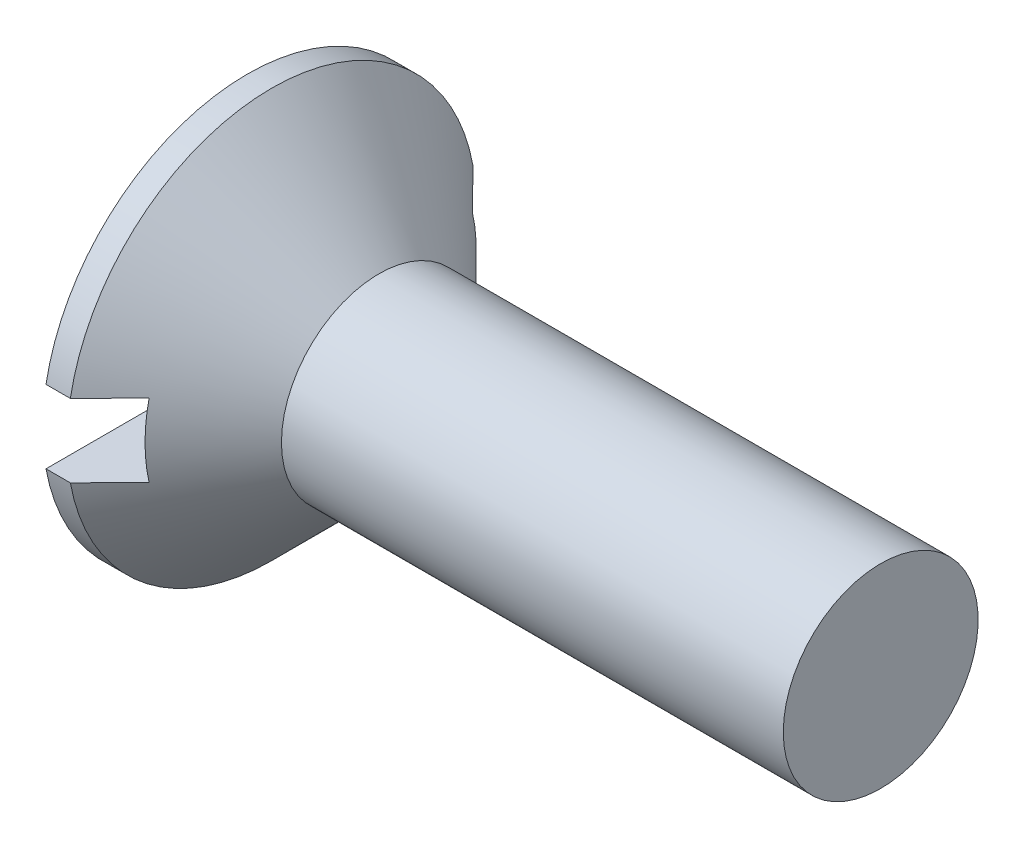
ISO-10303-21;
HEADER;
FILE_DESCRIPTION(('STEP AP214'),'2;1');
FILE_NAME('part.step','',(''),(''),'','','');
FILE_SCHEMA(('AUTOMOTIVE_DESIGN { 1 0 10303 214 1 1 1 1 }'));
ENDSEC;
DATA;
#1=APPLICATION_CONTEXT('core data for automotive mechanical design processes');
#2=APPLICATION_PROTOCOL_DEFINITION('international standard','automotive_design',2000,#1);
#3=PRODUCT_CONTEXT('',#1,'mechanical');
#4=PRODUCT('Part','Part','',(#3));
#5=PRODUCT_RELATED_PRODUCT_CATEGORY('part','',(#4));
#6=PRODUCT_DEFINITION_FORMATION('','',#4);
#7=PRODUCT_DEFINITION_CONTEXT('part definition',#1,'design');
#8=PRODUCT_DEFINITION('design','',#6,#7);
#9=PRODUCT_DEFINITION_SHAPE('','',#8);
#10=(LENGTH_UNIT() NAMED_UNIT(*) SI_UNIT(.MILLI.,.METRE.));
#11=(NAMED_UNIT(*) PLANE_ANGLE_UNIT() SI_UNIT($,.RADIAN.));
#12=(NAMED_UNIT(*) SI_UNIT($,.STERADIAN.) SOLID_ANGLE_UNIT());
#13=UNCERTAINTY_MEASURE_WITH_UNIT(LENGTH_MEASURE(1.E-05),#10,'distance_accuracy_value','');
#14=(GEOMETRIC_REPRESENTATION_CONTEXT(3) GLOBAL_UNCERTAINTY_ASSIGNED_CONTEXT((#13)) GLOBAL_UNIT_ASSIGNED_CONTEXT((#10,
#11,#12)) REPRESENTATION_CONTEXT('',''));
#15=CARTESIAN_POINT('',(0.,0.,0.));
#16=DIRECTION('',(0.,0.,1.));
#17=DIRECTION('',(1.,0.,0.));
#18=AXIS2_PLACEMENT_3D('',#15,#16,#17);
#19=CARTESIAN_POINT('',(0.,0.,0.));
#20=DIRECTION('',(-1.,0.,0.));
#21=DIRECTION('',(0.,0.,1.));
#22=AXIS2_PLACEMENT_3D('',#19,#20,#21);
#23=PLANE('',#22);
#24=DIRECTION('',(0.,0.,-1.));
#25=VECTOR('',#24,1.);
#26=CARTESIAN_POINT('',(0.,0.749999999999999,4.2));
#27=LINE('',#26,#25);
#28=CARTESIAN_POINT('',(0.,0.750000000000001,4.13249319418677));
#29=VERTEX_POINT('',#28);
#30=CARTESIAN_POINT('',(0.,0.750000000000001,-4.13249319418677));
#31=VERTEX_POINT('',#30);
#32=EDGE_CURVE('E161',#29,#31,#27,.T.);
#33=ORIENTED_EDGE('',*,*,#32,.F.);
#34=CARTESIAN_POINT('',(0.,0.,0.));
#35=DIRECTION('',(-1.,0.,0.));
#36=DIRECTION('',(0.,0.,1.));
#37=AXIS2_PLACEMENT_3D('',#34,#35,#36);
#38=CIRCLE('',#37,4.2);
#39=EDGE_CURVE('E112',#29,#31,#38,.T.);
#40=ORIENTED_EDGE('',*,*,#39,.T.);
#41=EDGE_LOOP('',(#33,#40));
#42=FACE_BOUND('',#41,.T.);
#43=ADVANCED_FACE('F31',(#42),#23,.T.);
#44=CARTESIAN_POINT('',(-6.34999999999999,0.,0.));
#45=DIRECTION('',(-1.,0.,0.));
#46=DIRECTION('',(0.,0.,1.));
#47=AXIS2_PLACEMENT_3D('',#44,#45,#46);
#48=CYLINDRICAL_SURFACE('',#47,4.2);
#49=DIRECTION('',(-1.,0.,0.));
#50=VECTOR('',#49,1.);
#51=CARTESIAN_POINT('',(-6.34999999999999,0.749999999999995,-4.13249319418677));
#52=LINE('',#51,#50);
#53=CARTESIAN_POINT('',(0.500000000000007,0.750000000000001,-4.13249319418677));
#54=VERTEX_POINT('',#53);
#55=EDGE_CURVE('E59',#31,#54,#52,.F.);
#56=ORIENTED_EDGE('',*,*,#55,.F.);
#57=ORIENTED_EDGE('',*,*,#39,.F.);
#58=DIRECTION('',(-1.,0.,0.));
#59=VECTOR('',#58,1.);
#60=CARTESIAN_POINT('',(-6.34999999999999,0.749999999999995,4.13249319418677));
#61=LINE('',#60,#59);
#62=CARTESIAN_POINT('',(0.500000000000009,0.750000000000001,4.13249319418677));
#63=VERTEX_POINT('',#62);
#64=EDGE_CURVE('E167',#63,#29,#61,.T.);
#65=ORIENTED_EDGE('',*,*,#64,.F.);
#66=CARTESIAN_POINT('',(0.500000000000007,0.,0.));
#67=DIRECTION('',(-1.,0.,0.));
#68=DIRECTION('',(0.,0.,1.));
#69=AXIS2_PLACEMENT_3D('',#66,#67,#68);
#70=CIRCLE('',#69,4.2);
#71=EDGE_CURVE('E106',#63,#54,#70,.T.);
#72=ORIENTED_EDGE('',*,*,#71,.T.);
#73=EDGE_LOOP('',(#56,#57,#65,#72));
#74=FACE_BOUND('',#73,.T.);
#75=ADVANCED_FACE('F146',(#74),#48,.T.);
#76=DIRECTION('',(0.,0.,1.));
#77=VECTOR('',#76,1.);
#78=CARTESIAN_POINT('',(0.,-0.75,-4.2));
#79=LINE('',#78,#77);
#80=CARTESIAN_POINT('',(0.,-0.749999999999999,-4.13249319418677));
#81=VERTEX_POINT('',#80);
#82=CARTESIAN_POINT('',(0.,-0.75,4.13249319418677));
#83=VERTEX_POINT('',#82);
#84=EDGE_CURVE('E100',#81,#83,#79,.T.);
#85=ORIENTED_EDGE('',*,*,#84,.F.);
#86=EDGE_CURVE('E108',#81,#83,#38,.T.);
#87=ORIENTED_EDGE('',*,*,#86,.T.);
#88=EDGE_LOOP('',(#85,#87));
#89=FACE_BOUND('',#88,.T.);
#90=ADVANCED_FACE('F33',(#89),#23,.T.);
#91=DIRECTION('',(-1.,0.,0.));
#92=VECTOR('',#91,1.);
#93=CARTESIAN_POINT('',(-6.34999999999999,-0.750000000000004,4.13249319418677));
#94=LINE('',#93,#92);
#95=CARTESIAN_POINT('',(0.500000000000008,-0.750000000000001,4.13249319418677));
#96=VERTEX_POINT('',#95);
#97=EDGE_CURVE('E166',#83,#96,#94,.F.);
#98=ORIENTED_EDGE('',*,*,#97,.F.);
#99=ORIENTED_EDGE('',*,*,#86,.F.);
#100=DIRECTION('',(-1.,0.,0.));
#101=VECTOR('',#100,1.);
#102=CARTESIAN_POINT('',(-6.34999999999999,-0.750000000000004,-4.13249319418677));
#103=LINE('',#102,#101);
#104=CARTESIAN_POINT('',(0.500000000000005,-0.75,-4.13249319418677));
#105=VERTEX_POINT('',#104);
#106=EDGE_CURVE('E164',#105,#81,#103,.T.);
#107=ORIENTED_EDGE('',*,*,#106,.F.);
#108=EDGE_CURVE('E109',#105,#96,#70,.T.);
#109=ORIENTED_EDGE('',*,*,#108,.T.);
#110=EDGE_LOOP('',(#98,#99,#107,#109));
#111=FACE_BOUND('',#110,.T.);
#112=ADVANCED_FACE('F142',(#111),#48,.T.);
#113=CARTESIAN_POINT('',(0.500000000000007,0.,0.));
#114=DIRECTION('',(-1.,0.,0.));
#115=DIRECTION('',(0.,0.,1.));
#116=AXIS2_PLACEMENT_3D('',#113,#114,#115);
#117=CONICAL_SURFACE('',#116,4.2,0.78539816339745);
#118=CARTESIAN_POINT('',(-4.56300554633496,0.749999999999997,-9.23259290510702));
#119=CARTESIAN_POINT('',(-4.23526326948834,0.750000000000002,-8.90376138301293));
#120=CARTESIAN_POINT('',(-3.90756945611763,0.750000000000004,-8.57488150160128));
#121=CARTESIAN_POINT('',(-3.25233001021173,0.750000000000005,-7.91694284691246));
#122=CARTESIAN_POINT('',(-2.92478438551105,0.750000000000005,-7.58788406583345));
#123=CARTESIAN_POINT('',(-2.26954632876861,0.750000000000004,-6.92915726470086));
#124=CARTESIAN_POINT('',(-1.94185416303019,0.750000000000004,-6.59948897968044));
#125=CARTESIAN_POINT('',(-1.28684467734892,0.750000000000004,-5.93981061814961));
#126=CARTESIAN_POINT('',(-0.959527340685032,0.750000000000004,-5.6098005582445));
#127=CARTESIAN_POINT('',(-0.322913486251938,0.750000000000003,-4.96680303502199));
#128=CARTESIAN_POINT('',(-0.0135864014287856,0.750000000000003,-4.65384586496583));
#129=CARTESIAN_POINT('',(0.449707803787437,0.750000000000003,-4.18368014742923));
#130=CARTESIAN_POINT('',(0.604033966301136,0.750000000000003,-4.02682552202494));
#131=CARTESIAN_POINT('',(0.912341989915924,0.750000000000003,-3.71278222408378));
#132=CARTESIAN_POINT('',(1.06632385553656,0.750000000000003,-3.5555935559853));
#133=CARTESIAN_POINT('',(1.37368370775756,0.750000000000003,-3.24083894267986));
#134=CARTESIAN_POINT('',(1.52706203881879,0.750000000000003,-3.08327333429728));
#135=CARTESIAN_POINT('',(1.83305350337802,0.750000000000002,-2.7673851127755));
#136=CARTESIAN_POINT('',(1.98566659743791,0.750000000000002,-2.6090624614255));
#137=CARTESIAN_POINT('',(2.28959188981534,0.750000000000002,-2.29124115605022));
#138=CARTESIAN_POINT('',(2.44090439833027,0.750000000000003,-2.13174280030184));
#139=CARTESIAN_POINT('',(2.66606492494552,0.750000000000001,-1.89081575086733));
#140=CARTESIAN_POINT('',(2.74081405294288,0.750000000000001,-1.81023013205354));
#141=CARTESIAN_POINT('',(2.88942806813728,0.750000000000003,-1.64824850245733));
#142=CARTESIAN_POINT('',(2.96329298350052,0.750000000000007,-1.56685251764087));
#143=CARTESIAN_POINT('',(3.05688081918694,0.750000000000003,-1.46200016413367));
#144=CARTESIAN_POINT('',(3.0772267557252,0.750000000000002,-1.43909972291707));
#145=CARTESIAN_POINT('',(3.11779716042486,0.750000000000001,-1.39319116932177));
#146=CARTESIAN_POINT('',(3.13802162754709,0.750000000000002,-1.37018305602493));
#147=CARTESIAN_POINT('',(3.19849216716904,0.750000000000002,-1.30097309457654));
#148=CARTESIAN_POINT('',(3.23853148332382,0.750000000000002,-1.25458997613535));
#149=CARTESIAN_POINT('',(3.31823077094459,0.750000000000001,-1.16077768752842));
#150=CARTESIAN_POINT('',(3.35788410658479,0.750000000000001,-1.1133428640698));
#151=CARTESIAN_POINT('',(3.43614676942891,0.750000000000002,-1.01763697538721));
#152=CARTESIAN_POINT('',(3.47475637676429,0.750000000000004,-0.969366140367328));
#153=CARTESIAN_POINT('',(3.55086364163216,0.750000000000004,-0.871199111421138));
#154=CARTESIAN_POINT('',(3.58834695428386,0.750000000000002,-0.821291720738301));
#155=CARTESIAN_POINT('',(3.66110266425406,0.750000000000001,-0.719768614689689));
#156=CARTESIAN_POINT('',(3.69637209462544,0.750000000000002,-0.668150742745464));
#157=CARTESIAN_POINT('',(3.7630336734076,0.750000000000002,-0.563070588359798));
#158=CARTESIAN_POINT('',(3.79445732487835,0.750000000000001,-0.509628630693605));
#159=CARTESIAN_POINT('',(3.85141305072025,0.750000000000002,-0.39975069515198));
#160=CARTESIAN_POINT('',(3.8769631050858,0.750000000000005,-0.343324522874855));
#161=CARTESIAN_POINT('',(3.91342441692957,0.750000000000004,-0.240650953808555));
#162=CARTESIAN_POINT('',(3.92636915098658,0.750000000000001,-0.195155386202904));
#163=CARTESIAN_POINT('',(3.94434345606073,0.750000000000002,-0.102703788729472));
#164=CARTESIAN_POINT('',(3.94940257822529,0.750000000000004,-0.055753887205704));
#165=CARTESIAN_POINT('',(3.95049788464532,0.750000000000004,0.0384726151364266));
#166=CARTESIAN_POINT('',(3.94649291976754,0.750000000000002,0.0857497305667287));
#167=CARTESIAN_POINT('',(3.9303305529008,0.750000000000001,0.178951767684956));
#168=CARTESIAN_POINT('',(3.91814641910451,0.750000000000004,0.224871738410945));
#169=CARTESIAN_POINT('',(3.88695489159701,0.750000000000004,0.317076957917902));
#170=CARTESIAN_POINT('',(3.86760703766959,0.750000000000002,0.363241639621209));
#171=CARTESIAN_POINT('',(3.8244611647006,0.750000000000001,0.453478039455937));
#172=CARTESIAN_POINT('',(3.80065475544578,0.750000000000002,0.49754561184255));
#173=CARTESIAN_POINT('',(3.74991469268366,0.750000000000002,0.584301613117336));
#174=CARTESIAN_POINT('',(3.72295673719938,0.750000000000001,0.626975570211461));
#175=CARTESIAN_POINT('',(3.66706524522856,0.750000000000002,0.710937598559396));
#176=CARTESIAN_POINT('',(3.63813350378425,0.750000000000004,0.752226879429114));
#177=CARTESIAN_POINT('',(3.57613166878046,0.750000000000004,0.837566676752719));
#178=CARTESIAN_POINT('',(3.54292655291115,0.750000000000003,0.881518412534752));
#179=CARTESIAN_POINT('',(3.4753458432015,0.750000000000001,0.9685157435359));
#180=CARTESIAN_POINT('',(3.44097009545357,0.750000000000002,1.01156121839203));
#181=CARTESIAN_POINT('',(3.33655965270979,0.750000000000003,1.13971545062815));
#182=CARTESIAN_POINT('',(3.26527273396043,0.750000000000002,1.22380080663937));
#183=CARTESIAN_POINT('',(3.12069291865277,0.750000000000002,1.39046829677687));
#184=CARTESIAN_POINT('',(3.04739670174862,0.750000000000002,1.47304751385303));
#185=CARTESIAN_POINT('',(2.89962816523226,0.750000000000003,1.6371031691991));
#186=CARTESIAN_POINT('',(2.82515618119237,0.750000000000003,1.71857991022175));
#187=CARTESIAN_POINT('',(2.67569201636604,0.750000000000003,1.88050119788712));
#188=CARTESIAN_POINT('',(2.60070273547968,0.750000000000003,1.96094843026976));
#189=CARTESIAN_POINT('',(2.45016317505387,0.750000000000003,2.1213263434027));
#190=CARTESIAN_POINT('',(2.37461285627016,0.750000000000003,2.20125698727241));
#191=CARTESIAN_POINT('',(2.14752706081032,0.750000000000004,2.44031223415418));
#192=CARTESIAN_POINT('',(1.99539710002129,0.750000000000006,2.59887160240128));
#193=CARTESIAN_POINT('',(1.7109697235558,0.750000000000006,2.89362330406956));
#194=CARTESIAN_POINT('',(1.57878698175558,0.750000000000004,3.02992666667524));
#195=CARTESIAN_POINT('',(1.31395904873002,0.750000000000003,3.3020836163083));
#196=CARTESIAN_POINT('',(1.18131385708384,0.750000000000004,3.43793720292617));
#197=CARTESIAN_POINT('',(0.782899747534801,0.750000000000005,3.84503827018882));
#198=CARTESIAN_POINT('',(0.516656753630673,0.750000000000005,4.11582145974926));
#199=CARTESIAN_POINT('',(-0.016642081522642,0.750000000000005,4.65684853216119));
#200=CARTESIAN_POINT('',(-0.283698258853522,0.750000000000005,4.92709208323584));
#201=CARTESIAN_POINT('',(-0.818229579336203,0.750000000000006,5.46716057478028));
#202=CARTESIAN_POINT('',(-1.08570471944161,0.750000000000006,5.73698551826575));
#203=CARTESIAN_POINT('',(-1.62050048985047,0.750000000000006,6.27593271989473));
#204=CARTESIAN_POINT('',(-1.88782068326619,0.750000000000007,6.54505541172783));
#205=CARTESIAN_POINT('',(-2.42265004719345,0.750000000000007,7.08311422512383));
#206=CARTESIAN_POINT('',(-2.69015921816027,0.750000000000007,7.35205034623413));
#207=CARTESIAN_POINT('',(-3.22516829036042,0.750000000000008,7.88964433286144));
#208=CARTESIAN_POINT('',(-3.49266811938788,0.750000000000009,8.15830227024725));
#209=CARTESIAN_POINT('',(-4.02776891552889,0.750000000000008,8.69551597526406));
#210=CARTESIAN_POINT('',(-4.29536988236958,0.750000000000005,8.96407174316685));
#211=CARTESIAN_POINT('',(-4.56300554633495,0.749999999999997,9.23259290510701));
#212=B_SPLINE_CURVE_WITH_KNOTS('',3,(#118,#119,#120,#121,#122,#123,#124,#125,#126,#127,#128,
#129,#130,#131,#132,#133,#134,#135,#136,#137,#138,#139,#140,#141,#142,#143,#144,#145,#146,#147,
#148,#149,#150,#151,#152,#153,#154,#155,#156,#157,#158,#159,#160,#161,#162,#163,#164,#165,#166,
#167,#168,#169,#170,#171,#172,#173,#174,#175,#176,#177,#178,#179,#180,#181,#182,#183,#184,#185,
#186,#187,#188,#189,#190,#191,#192,#193,#194,#195,#196,#197,#198,#199,#200,#201,#202,#203,#204,
#205,#206,#207,#208,#209,#210,#211),.UNSPECIFIED.,.F.,.F.,(4,2,2,2,2,2,2,2,2,2,2,2,2,2,2,2,2,2,
2,2,2,2,2,2,2,2,2,2,2,2,2,2,2,2,2,2,2,2,2,2,2,2,2,2,2,2,4),(0.,1.39280532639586,
2.78567725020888,4.18015545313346,5.57456881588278,6.89465415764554,7.55478970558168,
8.21491653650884,8.8745860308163,9.53428918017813,10.1938303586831,10.5235740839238,
10.8533072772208,10.9452062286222,11.0371059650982,11.2209229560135,11.4063907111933,
11.5918081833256,11.7790168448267,11.9664712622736,12.1522695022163,12.337491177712,
12.4788735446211,12.6197247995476,12.7612167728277,12.9031734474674,13.0529905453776,
13.2030924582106,13.3544394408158,13.5056505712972,13.670877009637,13.8361252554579,
14.1667762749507,14.4980112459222,14.8291533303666,15.1590839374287,15.4890378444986,
16.1482428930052,16.717854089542,17.2874658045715,18.4267084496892,19.5665128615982,
20.7063090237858,21.8442825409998,22.9822588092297,24.1196238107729,25.2569857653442),.UNSPECIFIED.);
#213=CARTESIAN_POINT('',(1.3,0.750000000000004,3.31624787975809));
#214=VERTEX_POINT('',#213);
#215=EDGE_CURVE('E11',#214,#63,#212,.T.);
#216=ORIENTED_EDGE('',*,*,#215,.F.);
#217=CARTESIAN_POINT('',(1.3,0.,0.));
#218=DIRECTION('',(1.,0.,0.));
#219=DIRECTION('',(0.,0.,-1.));
#220=AXIS2_PLACEMENT_3D('',#217,#218,#219);
#221=CIRCLE('',#220,3.40000000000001);
#222=CARTESIAN_POINT('',(1.3,-0.749999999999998,3.31624787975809));
#223=VERTEX_POINT('',#222);
#224=EDGE_CURVE('E88',#223,#214,#221,.F.);
#225=ORIENTED_EDGE('',*,*,#224,.F.);
#226=CARTESIAN_POINT('',(-4.56300554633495,-0.750000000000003,9.23259290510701));
#227=CARTESIAN_POINT('',(-4.23526326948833,-0.749999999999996,8.90376138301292));
#228=CARTESIAN_POINT('',(-3.90756945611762,-0.749999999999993,8.57488150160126));
#229=CARTESIAN_POINT('',(-3.25233001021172,-0.749999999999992,7.91694284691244));
#230=CARTESIAN_POINT('',(-2.92478438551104,-0.749999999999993,7.58788406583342));
#231=CARTESIAN_POINT('',(-2.2695463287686,-0.749999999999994,6.92915726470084));
#232=CARTESIAN_POINT('',(-1.94185416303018,-0.749999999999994,6.59948897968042));
#233=CARTESIAN_POINT('',(-1.2868446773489,-0.749999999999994,5.93981061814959));
#234=CARTESIAN_POINT('',(-0.959527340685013,-0.749999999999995,5.60980055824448));
#235=CARTESIAN_POINT('',(-0.322913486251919,-0.749999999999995,4.96680303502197));
#236=CARTESIAN_POINT('',(-0.0135864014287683,-0.749999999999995,4.65384586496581));
#237=CARTESIAN_POINT('',(0.449707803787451,-0.749999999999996,4.18368014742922));
#238=CARTESIAN_POINT('',(0.604033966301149,-0.749999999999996,4.02682552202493));
#239=CARTESIAN_POINT('',(0.912341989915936,-0.749999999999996,3.71278222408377));
#240=CARTESIAN_POINT('',(1.06632385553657,-0.749999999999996,3.55559355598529));
#241=CARTESIAN_POINT('',(1.37368370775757,-0.749999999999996,3.24083894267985));
#242=CARTESIAN_POINT('',(1.5270620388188,-0.749999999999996,3.08327333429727));
#243=CARTESIAN_POINT('',(1.83305350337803,-0.749999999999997,2.76738511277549));
#244=CARTESIAN_POINT('',(1.98566659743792,-0.749999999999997,2.60906246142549));
#245=CARTESIAN_POINT('',(2.28959188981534,-0.749999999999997,2.29124115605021));
#246=CARTESIAN_POINT('',(2.44090439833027,-0.749999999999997,2.13174280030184));
#247=CARTESIAN_POINT('',(2.66606492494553,-0.749999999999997,1.89081575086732));
#248=CARTESIAN_POINT('',(2.74081405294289,-0.749999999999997,1.81023013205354));
#249=CARTESIAN_POINT('',(2.88942806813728,-0.749999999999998,1.64824850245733));
#250=CARTESIAN_POINT('',(2.96329298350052,-0.749999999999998,1.56685251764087));
#251=CARTESIAN_POINT('',(3.05688081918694,-0.749999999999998,1.46200016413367));
#252=CARTESIAN_POINT('',(3.07722675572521,-0.749999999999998,1.43909972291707));
#253=CARTESIAN_POINT('',(3.11779716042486,-0.749999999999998,1.39319116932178));
#254=CARTESIAN_POINT('',(3.13802162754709,-0.749999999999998,1.37018305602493));
#255=CARTESIAN_POINT('',(3.19849216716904,-0.749999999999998,1.30097309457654));
#256=CARTESIAN_POINT('',(3.23853148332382,-0.749999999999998,1.25458997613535));
#257=CARTESIAN_POINT('',(3.31823077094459,-0.749999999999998,1.16077768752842));
#258=CARTESIAN_POINT('',(3.35788410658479,-0.749999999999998,1.1133428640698));
#259=CARTESIAN_POINT('',(3.43614676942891,-0.749999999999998,1.01763697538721));
#260=CARTESIAN_POINT('',(3.47475637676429,-0.749999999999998,0.969366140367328));
#261=CARTESIAN_POINT('',(3.55086364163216,-0.749999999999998,0.871199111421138));
#262=CARTESIAN_POINT('',(3.58834695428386,-0.749999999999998,0.8212917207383));
#263=CARTESIAN_POINT('',(3.66110266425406,-0.749999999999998,0.719768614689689));
#264=CARTESIAN_POINT('',(3.69637209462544,-0.749999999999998,0.668150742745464));
#265=CARTESIAN_POINT('',(3.7630336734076,-0.749999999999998,0.563070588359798));
#266=CARTESIAN_POINT('',(3.79445732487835,-0.749999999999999,0.509628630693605));
#267=CARTESIAN_POINT('',(3.85141305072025,-0.749999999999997,0.39975069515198));
#268=CARTESIAN_POINT('',(3.8769631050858,-0.749999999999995,0.343324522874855));
#269=CARTESIAN_POINT('',(3.91342441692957,-0.749999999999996,0.240650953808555));
#270=CARTESIAN_POINT('',(3.92636915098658,-0.749999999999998,0.195155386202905));
#271=CARTESIAN_POINT('',(3.94434345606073,-0.749999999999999,0.102703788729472));
#272=CARTESIAN_POINT('',(3.94940257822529,-0.749999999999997,0.0557538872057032));
#273=CARTESIAN_POINT('',(3.95049788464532,-0.749999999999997,-0.0384726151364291));
#274=CARTESIAN_POINT('',(3.94649291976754,-0.749999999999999,-0.0857497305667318));
#275=CARTESIAN_POINT('',(3.9303305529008,-0.749999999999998,-0.178951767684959));
#276=CARTESIAN_POINT('',(3.91814641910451,-0.749999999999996,-0.224871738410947));
#277=CARTESIAN_POINT('',(3.886954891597,-0.749999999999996,-0.317076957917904));
#278=CARTESIAN_POINT('',(3.86760703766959,-0.749999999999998,-0.363241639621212));
#279=CARTESIAN_POINT('',(3.8244611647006,-0.749999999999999,-0.453478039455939));
#280=CARTESIAN_POINT('',(3.80065475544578,-0.749999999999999,-0.497545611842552));
#281=CARTESIAN_POINT('',(3.74991469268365,-0.749999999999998,-0.584301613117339));
#282=CARTESIAN_POINT('',(3.72295673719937,-0.749999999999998,-0.626975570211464));
#283=CARTESIAN_POINT('',(3.66706524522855,-0.749999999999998,-0.710937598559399));
#284=CARTESIAN_POINT('',(3.63813350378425,-0.749999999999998,-0.752226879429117));
#285=CARTESIAN_POINT('',(3.57613166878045,-0.749999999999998,-0.837566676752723));
#286=CARTESIAN_POINT('',(3.54292655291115,-0.749999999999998,-0.881518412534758));
#287=CARTESIAN_POINT('',(3.4753458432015,-0.749999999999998,-0.968515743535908));
#288=CARTESIAN_POINT('',(3.44097009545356,-0.749999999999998,-1.01156121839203));
#289=CARTESIAN_POINT('',(3.33655965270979,-0.749999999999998,-1.13971545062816));
#290=CARTESIAN_POINT('',(3.26527273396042,-0.749999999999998,-1.22380080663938));
#291=CARTESIAN_POINT('',(3.12069291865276,-0.749999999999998,-1.39046829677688));
#292=CARTESIAN_POINT('',(3.04739670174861,-0.749999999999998,-1.47304751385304));
#293=CARTESIAN_POINT('',(2.89962816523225,-0.749999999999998,-1.63710316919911));
#294=CARTESIAN_POINT('',(2.82515618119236,-0.749999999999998,-1.71857991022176));
#295=CARTESIAN_POINT('',(2.67569201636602,-0.749999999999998,-1.88050119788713));
#296=CARTESIAN_POINT('',(2.60070273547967,-0.749999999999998,-1.96094843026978));
#297=CARTESIAN_POINT('',(2.45016317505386,-0.749999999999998,-2.12132634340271));
#298=CARTESIAN_POINT('',(2.37461285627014,-0.749999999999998,-2.20125698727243));
#299=CARTESIAN_POINT('',(2.1475270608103,-0.749999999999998,-2.4403122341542));
#300=CARTESIAN_POINT('',(1.99539710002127,-0.749999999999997,-2.5988716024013));
#301=CARTESIAN_POINT('',(1.71096972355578,-0.749999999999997,-2.89362330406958));
#302=CARTESIAN_POINT('',(1.57878698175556,-0.749999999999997,-3.02992666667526));
#303=CARTESIAN_POINT('',(1.31395904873,-0.749999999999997,-3.30208361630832));
#304=CARTESIAN_POINT('',(1.18131385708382,-0.749999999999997,-3.43793720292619));
#305=CARTESIAN_POINT('',(0.782899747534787,-0.749999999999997,-3.84503827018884));
#306=CARTESIAN_POINT('',(0.51665675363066,-0.749999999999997,-4.11582145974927));
#307=CARTESIAN_POINT('',(-0.0166420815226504,-0.749999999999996,-4.6568485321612));
#308=CARTESIAN_POINT('',(-0.283698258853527,-0.749999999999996,-4.92709208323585));
#309=CARTESIAN_POINT('',(-0.818229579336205,-0.749999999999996,-5.46716057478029));
#310=CARTESIAN_POINT('',(-1.08570471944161,-0.749999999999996,-5.73698551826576));
#311=CARTESIAN_POINT('',(-1.62050048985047,-0.749999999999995,-6.27593271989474));
#312=CARTESIAN_POINT('',(-1.88782068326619,-0.749999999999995,-6.54505541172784));
#313=CARTESIAN_POINT('',(-2.42265004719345,-0.749999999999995,-7.08311422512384));
#314=CARTESIAN_POINT('',(-2.69015921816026,-0.749999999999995,-7.35205034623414));
#315=CARTESIAN_POINT('',(-3.22516829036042,-0.749999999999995,-7.88964433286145));
#316=CARTESIAN_POINT('',(-3.49266811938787,-0.749999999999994,-8.15830227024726));
#317=CARTESIAN_POINT('',(-4.02776891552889,-0.749999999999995,-8.69551597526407));
#318=CARTESIAN_POINT('',(-4.29536988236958,-0.749999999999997,-8.96407174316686));
#319=CARTESIAN_POINT('',(-4.56300554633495,-0.750000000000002,-9.23259290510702));
#320=B_SPLINE_CURVE_WITH_KNOTS('',3,(#226,#227,#228,#229,#230,#231,#232,#233,#234,#235,#236,
#237,#238,#239,#240,#241,#242,#243,#244,#245,#246,#247,#248,#249,#250,#251,#252,#253,#254,#255,
#256,#257,#258,#259,#260,#261,#262,#263,#264,#265,#266,#267,#268,#269,#270,#271,#272,#273,#274,
#275,#276,#277,#278,#279,#280,#281,#282,#283,#284,#285,#286,#287,#288,#289,#290,#291,#292,#293,
#294,#295,#296,#297,#298,#299,#300,#301,#302,#303,#304,#305,#306,#307,#308,#309,#310,#311,#312,
#313,#314,#315,#316,#317,#318,#319),.UNSPECIFIED.,.F.,.F.,(4,2,2,2,2,2,2,2,2,2,2,2,2,2,2,2,2,2,
2,2,2,2,2,2,2,2,2,2,2,2,2,2,2,2,2,2,2,2,2,2,2,2,2,2,2,2,4),(0.,1.39280532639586,
2.78567725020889,4.18015545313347,5.5745688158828,6.89465415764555,7.55478970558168,
8.21491653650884,8.87458603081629,9.53428918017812,10.1938303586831,10.5235740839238,
10.8533072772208,10.9452062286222,11.0371059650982,11.2209229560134,11.4063907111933,
11.5918081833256,11.7790168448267,11.9664712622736,12.1522695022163,12.337491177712,
12.4788735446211,12.6197247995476,12.7612167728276,12.9031734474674,13.0529905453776,
13.2030924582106,13.3544394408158,13.5056505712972,13.670877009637,13.8361252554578,
14.1667762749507,14.4980112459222,14.8291533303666,15.1590839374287,15.4890378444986,
16.1482428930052,16.717854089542,17.2874658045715,18.4267084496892,19.5665128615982,
20.7063090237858,21.8442825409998,22.9822588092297,24.1196238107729,25.2569857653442),.UNSPECIFIED.);
#321=EDGE_CURVE('E45',#96,#223,#320,.T.);
#322=ORIENTED_EDGE('',*,*,#321,.F.);
#323=ORIENTED_EDGE('',*,*,#108,.F.);
#324=CARTESIAN_POINT('',(1.3,-0.749999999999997,-3.31624787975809));
#325=VERTEX_POINT('',#324);
#326=EDGE_CURVE('E118',#325,#105,#320,.T.);
#327=ORIENTED_EDGE('',*,*,#326,.F.);
#328=CARTESIAN_POINT('',(1.3,0.750000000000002,-3.31624787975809));
#329=VERTEX_POINT('',#328);
#330=EDGE_CURVE('E96',#329,#325,#221,.F.);
#331=ORIENTED_EDGE('',*,*,#330,.F.);
#332=EDGE_CURVE('E35',#54,#329,#212,.T.);
#333=ORIENTED_EDGE('',*,*,#332,.F.);
#334=ORIENTED_EDGE('',*,*,#71,.F.);
#335=EDGE_LOOP('',(#216,#225,#322,#323,#327,#331,#333,#334));
#336=FACE_BOUND('',#335,.T.);
#337=CARTESIAN_POINT('',(2.7,0.,0.));
#338=DIRECTION('',(-1.,0.,0.));
#339=DIRECTION('',(0.,0.,1.));
#340=AXIS2_PLACEMENT_3D('',#337,#338,#339);
#341=CIRCLE('',#340,2.);
#342=CARTESIAN_POINT('',(2.7,0.,2.));
#343=VERTEX_POINT('',#342);
#344=EDGE_CURVE('E115',#343,#343,#341,.T.);
#345=ORIENTED_EDGE('',*,*,#344,.T.);
#346=EDGE_LOOP('',(#345));
#347=FACE_BOUND('',#346,.T.);
#348=ADVANCED_FACE('F103',(#336,#347),#117,.T.);
#349=CARTESIAN_POINT('',(-6.34999999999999,0.,0.));
#350=DIRECTION('',(-1.,0.,0.));
#351=DIRECTION('',(0.,0.,1.));
#352=AXIS2_PLACEMENT_3D('',#349,#350,#351);
#353=CYLINDRICAL_SURFACE('',#352,2.);
#354=CARTESIAN_POINT('',(13.,0.,0.));
#355=DIRECTION('',(-1.,0.,0.));
#356=DIRECTION('',(0.,0.,1.));
#357=AXIS2_PLACEMENT_3D('',#354,#355,#356);
#358=CIRCLE('',#357,2.);
#359=CARTESIAN_POINT('',(13.,0.,2.));
#360=VERTEX_POINT('',#359);
#361=EDGE_CURVE('E173',#360,#360,#358,.T.);
#362=ORIENTED_EDGE('',*,*,#361,.T.);
#363=EDGE_LOOP('',(#362));
#364=FACE_BOUND('',#363,.T.);
#365=ORIENTED_EDGE('',*,*,#344,.F.);
#366=EDGE_LOOP('',(#365));
#367=FACE_BOUND('',#366,.T.);
#368=ADVANCED_FACE('F135',(#364,#367),#353,.T.);
#369=CARTESIAN_POINT('',(13.,2.00000000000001,0.));
#370=DIRECTION('',(1.,0.,0.));
#371=DIRECTION('',(0.,0.,-1.));
#372=AXIS2_PLACEMENT_3D('',#369,#370,#371);
#373=PLANE('',#372);
#374=ORIENTED_EDGE('',*,*,#361,.F.);
#375=EDGE_LOOP('',(#374));
#376=FACE_BOUND('',#375,.T.);
#377=ADVANCED_FACE('F133',(#376),#373,.T.);
#378=CARTESIAN_POINT('',(1.3,0.750000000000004,4.2));
#379=DIRECTION('',(0.,1.,0.));
#380=DIRECTION('',(0.,0.,1.));
#381=AXIS2_PLACEMENT_3D('',#378,#379,#380);
#382=PLANE('',#381);
#383=ORIENTED_EDGE('',*,*,#55,.T.);
#384=ORIENTED_EDGE('',*,*,#332,.T.);
#385=DIRECTION('',(0.,0.,-1.));
#386=VECTOR('',#385,1.);
#387=CARTESIAN_POINT('',(1.3,0.750000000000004,4.2));
#388=LINE('',#387,#386);
#389=EDGE_CURVE('E52',#214,#329,#388,.T.);
#390=ORIENTED_EDGE('',*,*,#389,.F.);
#391=ORIENTED_EDGE('',*,*,#215,.T.);
#392=ORIENTED_EDGE('',*,*,#64,.T.);
#393=ORIENTED_EDGE('',*,*,#32,.T.);
#394=EDGE_LOOP('',(#383,#384,#390,#391,#392,#393));
#395=FACE_BOUND('',#394,.T.);
#396=ADVANCED_FACE('F97',(#395),#382,.F.);
#397=CARTESIAN_POINT('',(1.3,-0.749999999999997,-4.2));
#398=DIRECTION('',(0.,-1.,0.));
#399=DIRECTION('',(0.,0.,-1.));
#400=AXIS2_PLACEMENT_3D('',#397,#398,#399);
#401=PLANE('',#400);
#402=ORIENTED_EDGE('',*,*,#97,.T.);
#403=ORIENTED_EDGE('',*,*,#321,.T.);
#404=DIRECTION('',(0.,0.,1.));
#405=VECTOR('',#404,1.);
#406=CARTESIAN_POINT('',(1.3,-0.749999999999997,-4.2));
#407=LINE('',#406,#405);
#408=EDGE_CURVE('E91',#325,#223,#407,.T.);
#409=ORIENTED_EDGE('',*,*,#408,.F.);
#410=ORIENTED_EDGE('',*,*,#326,.T.);
#411=ORIENTED_EDGE('',*,*,#106,.T.);
#412=ORIENTED_EDGE('',*,*,#84,.T.);
#413=EDGE_LOOP('',(#402,#403,#409,#410,#411,#412));
#414=FACE_BOUND('',#413,.T.);
#415=ADVANCED_FACE('F125',(#414),#401,.F.);
#416=CARTESIAN_POINT('',(1.3,-0.749999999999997,-4.2));
#417=DIRECTION('',(1.,0.,0.));
#418=DIRECTION('',(0.,0.,-1.));
#419=AXIS2_PLACEMENT_3D('',#416,#417,#418);
#420=PLANE('',#419);
#421=ORIENTED_EDGE('',*,*,#224,.T.);
#422=ORIENTED_EDGE('',*,*,#389,.T.);
#423=ORIENTED_EDGE('',*,*,#330,.T.);
#424=ORIENTED_EDGE('',*,*,#408,.T.);
#425=EDGE_LOOP('',(#421,#422,#423,#424));
#426=FACE_BOUND('',#425,.T.);
#427=ADVANCED_FACE('F89',(#426),#420,.F.);
#428=CLOSED_SHELL('',(#43,#75,#90,#112,#348,#368,#377,#396,#415,#427));
#429=MANIFOLD_SOLID_BREP('B2',#428);
#430=ADVANCED_BREP_SHAPE_REPRESENTATION('',(#18,#429),#14);
#431=SHAPE_DEFINITION_REPRESENTATION(#9,#430);
ENDSEC;
END-ISO-10303-21;
